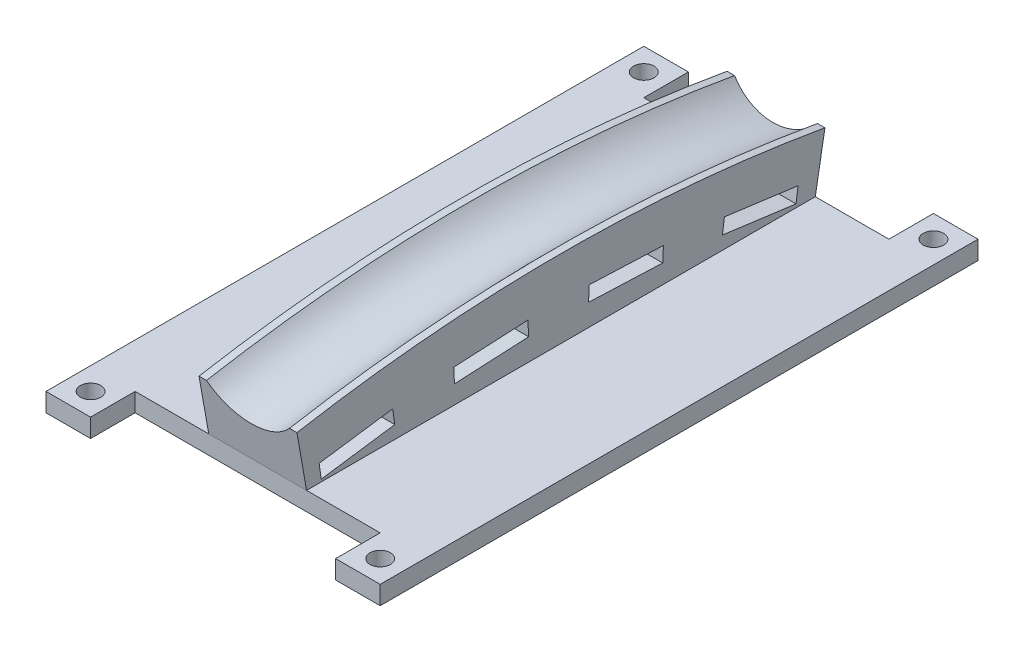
ISO-10303-21;
HEADER;
FILE_DESCRIPTION(('STEP AP214'),'2;1');
FILE_NAME('part.step','',(''),(''),'','','');
FILE_SCHEMA(('AUTOMOTIVE_DESIGN { 1 0 10303 214 1 1 1 1 }'));
ENDSEC;
DATA;
#1=APPLICATION_CONTEXT('core data for automotive mechanical design processes');
#2=APPLICATION_PROTOCOL_DEFINITION('international standard','automotive_design',2000,#1);
#3=PRODUCT_CONTEXT('',#1,'mechanical');
#4=PRODUCT('Part','Part','',(#3));
#5=PRODUCT_RELATED_PRODUCT_CATEGORY('part','',(#4));
#6=PRODUCT_DEFINITION_FORMATION('','',#4);
#7=PRODUCT_DEFINITION_CONTEXT('part definition',#1,'design');
#8=PRODUCT_DEFINITION('design','',#6,#7);
#9=PRODUCT_DEFINITION_SHAPE('','',#8);
#10=(LENGTH_UNIT() NAMED_UNIT(*) SI_UNIT(.MILLI.,.METRE.));
#11=(NAMED_UNIT(*) PLANE_ANGLE_UNIT() SI_UNIT($,.RADIAN.));
#12=(NAMED_UNIT(*) SI_UNIT($,.STERADIAN.) SOLID_ANGLE_UNIT());
#13=UNCERTAINTY_MEASURE_WITH_UNIT(LENGTH_MEASURE(1.E-05),#10,'distance_accuracy_value','');
#14=(GEOMETRIC_REPRESENTATION_CONTEXT(3) GLOBAL_UNCERTAINTY_ASSIGNED_CONTEXT((#13)) GLOBAL_UNIT_ASSIGNED_CONTEXT((#10,
#11,#12)) REPRESENTATION_CONTEXT('',''));
#15=CARTESIAN_POINT('',(0.,0.,0.));
#16=DIRECTION('',(0.,0.,1.));
#17=DIRECTION('',(1.,0.,0.));
#18=AXIS2_PLACEMENT_3D('',#15,#16,#17);
#19=CARTESIAN_POINT('',(0.,5.,0.));
#20=DIRECTION('',(0.,1.,0.));
#21=DIRECTION('',(0.,0.,1.));
#22=AXIS2_PLACEMENT_3D('',#19,#20,#21);
#23=PLANE('',#22);
#24=CARTESIAN_POINT('',(6.00000000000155,5.,-6.00000000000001));
#25=DIRECTION('',(0.,1.,0.));
#26=DIRECTION('',(0.,0.,1.));
#27=AXIS2_PLACEMENT_3D('',#24,#25,#26);
#28=CIRCLE('',#27,2.75);
#29=CARTESIAN_POINT('',(6.00000000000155,5.,-3.25));
#30=VERTEX_POINT('',#29);
#31=EDGE_CURVE('E469',#30,#30,#28,.T.);
#32=ORIENTED_EDGE('',*,*,#31,.F.);
#33=EDGE_LOOP('',(#32));
#34=FACE_BOUND('',#33,.T.);
#35=CARTESIAN_POINT('',(6.,5.,-155.));
#36=DIRECTION('',(0.,1.,0.));
#37=DIRECTION('',(0.,0.,1.));
#38=AXIS2_PLACEMENT_3D('',#35,#36,#37);
#39=CIRCLE('',#38,2.75);
#40=CARTESIAN_POINT('',(6.,5.,-152.25));
#41=VERTEX_POINT('',#40);
#42=EDGE_CURVE('E487',#41,#41,#39,.T.);
#43=ORIENTED_EDGE('',*,*,#42,.F.);
#44=EDGE_LOOP('',(#43));
#45=FACE_BOUND('',#44,.T.);
#46=DIRECTION('',(1.,0.,0.));
#47=VECTOR('',#46,1.);
#48=CARTESIAN_POINT('',(12.,5.,-12.));
#49=LINE('',#48,#47);
#50=CARTESIAN_POINT('',(12.,5.,-12.));
#51=VERTEX_POINT('',#50);
#52=CARTESIAN_POINT('',(31.8196601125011,5.,-12.));
#53=VERTEX_POINT('',#52);
#54=EDGE_CURVE('E502',#51,#53,#49,.T.);
#55=ORIENTED_EDGE('',*,*,#54,.T.);
#56=DIRECTION('',(0.,0.,-1.));
#57=VECTOR('',#56,1.);
#58=CARTESIAN_POINT('',(31.8196601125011,5.,-12.));
#59=LINE('',#58,#57);
#60=CARTESIAN_POINT('',(31.8196601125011,5.,-149.));
#61=VERTEX_POINT('',#60);
#62=EDGE_CURVE('E460',#53,#61,#59,.T.);
#63=ORIENTED_EDGE('',*,*,#62,.T.);
#64=DIRECTION('',(-1.,0.,0.));
#65=VECTOR('',#64,1.);
#66=CARTESIAN_POINT('',(78.,5.,-149.));
#67=LINE('',#66,#65);
#68=CARTESIAN_POINT('',(12.,5.,-149.));
#69=VERTEX_POINT('',#68);
#70=EDGE_CURVE('E515',#61,#69,#67,.T.);
#71=ORIENTED_EDGE('',*,*,#70,.T.);
#72=DIRECTION('',(0.,0.,-1.));
#73=VECTOR('',#72,1.);
#74=CARTESIAN_POINT('',(12.,5.,-149.));
#75=LINE('',#74,#73);
#76=CARTESIAN_POINT('',(12.,5.,-161.));
#77=VERTEX_POINT('',#76);
#78=EDGE_CURVE('E518',#69,#77,#75,.T.);
#79=ORIENTED_EDGE('',*,*,#78,.T.);
#80=DIRECTION('',(-1.,0.,0.));
#81=VECTOR('',#80,1.);
#82=CARTESIAN_POINT('',(12.,5.,-161.));
#83=LINE('',#82,#81);
#84=CARTESIAN_POINT('',(0.,5.,-161.));
#85=VERTEX_POINT('',#84);
#86=EDGE_CURVE('E520',#77,#85,#83,.T.);
#87=ORIENTED_EDGE('',*,*,#86,.T.);
#88=DIRECTION('',(0.,0.,1.));
#89=VECTOR('',#88,1.);
#90=CARTESIAN_POINT('',(0.,5.,-161.));
#91=LINE('',#90,#89);
#92=CARTESIAN_POINT('',(0.,5.,0.));
#93=VERTEX_POINT('',#92);
#94=EDGE_CURVE('E493',#85,#93,#91,.T.);
#95=ORIENTED_EDGE('',*,*,#94,.T.);
#96=DIRECTION('',(1.,0.,0.));
#97=VECTOR('',#96,1.);
#98=CARTESIAN_POINT('',(0.,5.,0.));
#99=LINE('',#98,#97);
#100=CARTESIAN_POINT('',(12.,5.,0.));
#101=VERTEX_POINT('',#100);
#102=EDGE_CURVE('E496',#93,#101,#99,.T.);
#103=ORIENTED_EDGE('',*,*,#102,.T.);
#104=DIRECTION('',(0.,0.,-1.));
#105=VECTOR('',#104,1.);
#106=CARTESIAN_POINT('',(12.,5.,0.));
#107=LINE('',#106,#105);
#108=EDGE_CURVE('E499',#101,#51,#107,.T.);
#109=ORIENTED_EDGE('',*,*,#108,.T.);
#110=EDGE_LOOP('',(#55,#63,#71,#79,#87,#95,#103,#109));
#111=FACE_BOUND('',#110,.T.);
#112=ADVANCED_FACE('F44',(#34,#45,#111),#23,.T.);
#113=DIRECTION('',(0.,0.,-1.));
#114=VECTOR('',#113,1.);
#115=CARTESIAN_POINT('',(58.1803398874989,5.,-12.));
#116=LINE('',#115,#114);
#117=CARTESIAN_POINT('',(58.1803398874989,5.,-12.));
#118=VERTEX_POINT('',#117);
#119=CARTESIAN_POINT('',(58.1803398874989,5.,-149.));
#120=VERTEX_POINT('',#119);
#121=EDGE_CURVE('E452',#118,#120,#116,.T.);
#122=ORIENTED_EDGE('',*,*,#121,.F.);
#123=CARTESIAN_POINT('',(78.,5.,-12.));
#124=VERTEX_POINT('',#123);
#125=EDGE_CURVE('E501',#118,#124,#49,.T.);
#126=ORIENTED_EDGE('',*,*,#125,.T.);
#127=DIRECTION('',(0.,0.,1.));
#128=VECTOR('',#127,1.);
#129=CARTESIAN_POINT('',(78.,5.,-12.));
#130=LINE('',#129,#128);
#131=CARTESIAN_POINT('',(78.,5.,0.));
#132=VERTEX_POINT('',#131);
#133=EDGE_CURVE('E505',#124,#132,#130,.T.);
#134=ORIENTED_EDGE('',*,*,#133,.T.);
#135=DIRECTION('',(1.,0.,0.));
#136=VECTOR('',#135,1.);
#137=CARTESIAN_POINT('',(78.,5.,0.));
#138=LINE('',#137,#136);
#139=CARTESIAN_POINT('',(90.,5.,0.));
#140=VERTEX_POINT('',#139);
#141=EDGE_CURVE('E507',#132,#140,#138,.T.);
#142=ORIENTED_EDGE('',*,*,#141,.T.);
#143=DIRECTION('',(0.,0.,-1.));
#144=VECTOR('',#143,1.);
#145=CARTESIAN_POINT('',(90.,5.,0.));
#146=LINE('',#145,#144);
#147=CARTESIAN_POINT('',(90.,5.,-161.));
#148=VERTEX_POINT('',#147);
#149=EDGE_CURVE('E509',#140,#148,#146,.T.);
#150=ORIENTED_EDGE('',*,*,#149,.T.);
#151=DIRECTION('',(-1.,0.,0.));
#152=VECTOR('',#151,1.);
#153=CARTESIAN_POINT('',(90.,5.,-161.));
#154=LINE('',#153,#152);
#155=CARTESIAN_POINT('',(78.,5.,-161.));
#156=VERTEX_POINT('',#155);
#157=EDGE_CURVE('E511',#148,#156,#154,.T.);
#158=ORIENTED_EDGE('',*,*,#157,.T.);
#159=DIRECTION('',(0.,0.,1.));
#160=VECTOR('',#159,1.);
#161=CARTESIAN_POINT('',(78.,5.,-161.));
#162=LINE('',#161,#160);
#163=CARTESIAN_POINT('',(78.,5.,-149.));
#164=VERTEX_POINT('',#163);
#165=EDGE_CURVE('E513',#156,#164,#162,.T.);
#166=ORIENTED_EDGE('',*,*,#165,.T.);
#167=EDGE_CURVE('E516',#164,#120,#67,.T.);
#168=ORIENTED_EDGE('',*,*,#167,.T.);
#169=EDGE_LOOP('',(#122,#126,#134,#142,#150,#158,#166,#168));
#170=FACE_BOUND('',#169,.T.);
#171=CARTESIAN_POINT('',(84.0000000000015,5.,-6.00000000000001));
#172=DIRECTION('',(0.,1.,0.));
#173=DIRECTION('',(0.,0.,1.));
#174=AXIS2_PLACEMENT_3D('',#171,#172,#173);
#175=CIRCLE('',#174,2.75000000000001);
#176=CARTESIAN_POINT('',(84.0000000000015,5.,-3.25));
#177=VERTEX_POINT('',#176);
#178=EDGE_CURVE('E475',#177,#177,#175,.T.);
#179=ORIENTED_EDGE('',*,*,#178,.F.);
#180=EDGE_LOOP('',(#179));
#181=FACE_BOUND('',#180,.T.);
#182=CARTESIAN_POINT('',(84.,5.,-155.));
#183=DIRECTION('',(0.,1.,0.));
#184=DIRECTION('',(0.,0.,1.));
#185=AXIS2_PLACEMENT_3D('',#182,#183,#184);
#186=CIRCLE('',#185,2.75000000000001);
#187=CARTESIAN_POINT('',(84.,5.,-152.25));
#188=VERTEX_POINT('',#187);
#189=EDGE_CURVE('E481',#188,#188,#186,.T.);
#190=ORIENTED_EDGE('',*,*,#189,.F.);
#191=EDGE_LOOP('',(#190));
#192=FACE_BOUND('',#191,.T.);
#193=ADVANCED_FACE('F600',(#170,#181,#192),#23,.T.);
#194=CARTESIAN_POINT('',(0.,0.,0.));
#195=DIRECTION('',(0.,1.,0.));
#196=DIRECTION('',(0.,0.,1.));
#197=AXIS2_PLACEMENT_3D('',#194,#195,#196);
#198=PLANE('',#197);
#199=DIRECTION('',(0.,0.,1.));
#200=VECTOR('',#199,1.);
#201=CARTESIAN_POINT('',(0.,0.,-161.));
#202=LINE('',#201,#200);
#203=CARTESIAN_POINT('',(0.,0.,-161.));
#204=VERTEX_POINT('',#203);
#205=CARTESIAN_POINT('',(0.,0.,0.));
#206=VERTEX_POINT('',#205);
#207=EDGE_CURVE('E490',#204,#206,#202,.T.);
#208=ORIENTED_EDGE('',*,*,#207,.F.);
#209=DIRECTION('',(-1.,0.,0.));
#210=VECTOR('',#209,1.);
#211=CARTESIAN_POINT('',(12.,0.,-161.));
#212=LINE('',#211,#210);
#213=CARTESIAN_POINT('',(12.,0.,-161.));
#214=VERTEX_POINT('',#213);
#215=EDGE_CURVE('E497',#214,#204,#212,.T.);
#216=ORIENTED_EDGE('',*,*,#215,.F.);
#217=DIRECTION('',(0.,0.,-1.));
#218=VECTOR('',#217,1.);
#219=CARTESIAN_POINT('',(12.,0.,-149.));
#220=LINE('',#219,#218);
#221=CARTESIAN_POINT('',(12.,0.,-149.));
#222=VERTEX_POINT('',#221);
#223=EDGE_CURVE('E543',#222,#214,#220,.T.);
#224=ORIENTED_EDGE('',*,*,#223,.F.);
#225=DIRECTION('',(-1.,0.,0.));
#226=VECTOR('',#225,1.);
#227=CARTESIAN_POINT('',(78.,0.,-149.));
#228=LINE('',#227,#226);
#229=CARTESIAN_POINT('',(78.,0.,-149.));
#230=VERTEX_POINT('',#229);
#231=EDGE_CURVE('E541',#230,#222,#228,.T.);
#232=ORIENTED_EDGE('',*,*,#231,.F.);
#233=DIRECTION('',(0.,0.,1.));
#234=VECTOR('',#233,1.);
#235=CARTESIAN_POINT('',(78.,0.,-161.));
#236=LINE('',#235,#234);
#237=CARTESIAN_POINT('',(78.,0.,-161.));
#238=VERTEX_POINT('',#237);
#239=EDGE_CURVE('E539',#238,#230,#236,.T.);
#240=ORIENTED_EDGE('',*,*,#239,.F.);
#241=DIRECTION('',(-1.,0.,0.));
#242=VECTOR('',#241,1.);
#243=CARTESIAN_POINT('',(90.,0.,-161.));
#244=LINE('',#243,#242);
#245=CARTESIAN_POINT('',(90.,0.,-161.));
#246=VERTEX_POINT('',#245);
#247=EDGE_CURVE('E537',#246,#238,#244,.T.);
#248=ORIENTED_EDGE('',*,*,#247,.F.);
#249=DIRECTION('',(0.,0.,-1.));
#250=VECTOR('',#249,1.);
#251=CARTESIAN_POINT('',(90.,0.,0.));
#252=LINE('',#251,#250);
#253=CARTESIAN_POINT('',(90.,0.,0.));
#254=VERTEX_POINT('',#253);
#255=EDGE_CURVE('E535',#254,#246,#252,.T.);
#256=ORIENTED_EDGE('',*,*,#255,.F.);
#257=DIRECTION('',(1.,0.,0.));
#258=VECTOR('',#257,1.);
#259=CARTESIAN_POINT('',(78.,0.,0.));
#260=LINE('',#259,#258);
#261=CARTESIAN_POINT('',(78.,0.,0.));
#262=VERTEX_POINT('',#261);
#263=EDGE_CURVE('E533',#262,#254,#260,.T.);
#264=ORIENTED_EDGE('',*,*,#263,.F.);
#265=DIRECTION('',(0.,0.,1.));
#266=VECTOR('',#265,1.);
#267=CARTESIAN_POINT('',(78.,0.,-12.));
#268=LINE('',#267,#266);
#269=CARTESIAN_POINT('',(78.,0.,-12.));
#270=VERTEX_POINT('',#269);
#271=EDGE_CURVE('E531',#270,#262,#268,.T.);
#272=ORIENTED_EDGE('',*,*,#271,.F.);
#273=DIRECTION('',(1.,0.,0.));
#274=VECTOR('',#273,1.);
#275=CARTESIAN_POINT('',(12.,0.,-12.));
#276=LINE('',#275,#274);
#277=CARTESIAN_POINT('',(12.,0.,-12.));
#278=VERTEX_POINT('',#277);
#279=EDGE_CURVE('E529',#278,#270,#276,.T.);
#280=ORIENTED_EDGE('',*,*,#279,.F.);
#281=DIRECTION('',(0.,0.,-1.));
#282=VECTOR('',#281,1.);
#283=CARTESIAN_POINT('',(12.,0.,0.));
#284=LINE('',#283,#282);
#285=CARTESIAN_POINT('',(12.,0.,0.));
#286=VERTEX_POINT('',#285);
#287=EDGE_CURVE('E527',#286,#278,#284,.T.);
#288=ORIENTED_EDGE('',*,*,#287,.F.);
#289=DIRECTION('',(1.,0.,0.));
#290=VECTOR('',#289,1.);
#291=CARTESIAN_POINT('',(0.,0.,0.));
#292=LINE('',#291,#290);
#293=EDGE_CURVE('E525',#206,#286,#292,.T.);
#294=ORIENTED_EDGE('',*,*,#293,.F.);
#295=EDGE_LOOP('',(#208,#216,#224,#232,#240,#248,#256,#264,#272,#280,#288,#294));
#296=FACE_BOUND('',#295,.T.);
#297=CARTESIAN_POINT('',(6.,0.,-155.));
#298=DIRECTION('',(0.,1.,0.));
#299=DIRECTION('',(0.,0.,1.));
#300=AXIS2_PLACEMENT_3D('',#297,#298,#299);
#301=CIRCLE('',#300,2.75);
#302=CARTESIAN_POINT('',(6.,0.,-152.25));
#303=VERTEX_POINT('',#302);
#304=EDGE_CURVE('E484',#303,#303,#301,.T.);
#305=ORIENTED_EDGE('',*,*,#304,.T.);
#306=EDGE_LOOP('',(#305));
#307=FACE_BOUND('',#306,.T.);
#308=CARTESIAN_POINT('',(84.,0.,-155.));
#309=DIRECTION('',(0.,1.,0.));
#310=DIRECTION('',(0.,0.,1.));
#311=AXIS2_PLACEMENT_3D('',#308,#309,#310);
#312=CIRCLE('',#311,2.75000000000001);
#313=CARTESIAN_POINT('',(84.,0.,-152.25));
#314=VERTEX_POINT('',#313);
#315=EDGE_CURVE('E478',#314,#314,#312,.T.);
#316=ORIENTED_EDGE('',*,*,#315,.T.);
#317=EDGE_LOOP('',(#316));
#318=FACE_BOUND('',#317,.T.);
#319=CARTESIAN_POINT('',(84.0000000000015,0.,-6.00000000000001));
#320=DIRECTION('',(0.,1.,0.));
#321=DIRECTION('',(0.,0.,1.));
#322=AXIS2_PLACEMENT_3D('',#319,#320,#321);
#323=CIRCLE('',#322,2.75000000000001);
#324=CARTESIAN_POINT('',(84.0000000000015,0.,-3.25));
#325=VERTEX_POINT('',#324);
#326=EDGE_CURVE('E472',#325,#325,#323,.T.);
#327=ORIENTED_EDGE('',*,*,#326,.T.);
#328=EDGE_LOOP('',(#327));
#329=FACE_BOUND('',#328,.T.);
#330=CARTESIAN_POINT('',(6.00000000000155,0.,-6.00000000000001));
#331=DIRECTION('',(0.,1.,0.));
#332=DIRECTION('',(0.,0.,1.));
#333=AXIS2_PLACEMENT_3D('',#330,#331,#332);
#334=CIRCLE('',#333,2.75);
#335=CARTESIAN_POINT('',(6.00000000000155,0.,-3.25));
#336=VERTEX_POINT('',#335);
#337=EDGE_CURVE('E468',#336,#336,#334,.T.);
#338=ORIENTED_EDGE('',*,*,#337,.T.);
#339=EDGE_LOOP('',(#338));
#340=FACE_BOUND('',#339,.T.);
#341=ADVANCED_FACE('F585',(#296,#307,#318,#329,#340),#198,.F.);
#342=CARTESIAN_POINT('',(0.,5.,-161.));
#343=DIRECTION('',(1.,0.,0.));
#344=DIRECTION('',(0.,0.,-1.));
#345=AXIS2_PLACEMENT_3D('',#342,#343,#344);
#346=PLANE('',#345);
#347=ORIENTED_EDGE('',*,*,#207,.T.);
#348=DIRECTION('',(0.,-1.,0.));
#349=VECTOR('',#348,1.);
#350=CARTESIAN_POINT('',(0.,5.,0.));
#351=LINE('',#350,#349);
#352=EDGE_CURVE('E11',#93,#206,#351,.T.);
#353=ORIENTED_EDGE('',*,*,#352,.F.);
#354=ORIENTED_EDGE('',*,*,#94,.F.);
#355=DIRECTION('',(0.,-1.,0.));
#356=VECTOR('',#355,1.);
#357=CARTESIAN_POINT('',(0.,5.,-161.));
#358=LINE('',#357,#356);
#359=EDGE_CURVE('E522',#85,#204,#358,.T.);
#360=ORIENTED_EDGE('',*,*,#359,.T.);
#361=EDGE_LOOP('',(#347,#353,#354,#360));
#362=FACE_BOUND('',#361,.T.);
#363=ADVANCED_FACE('F46',(#362),#346,.F.);
#364=CARTESIAN_POINT('',(0.,5.,0.));
#365=DIRECTION('',(0.,0.,-1.));
#366=DIRECTION('',(-1.,0.,0.));
#367=AXIS2_PLACEMENT_3D('',#364,#365,#366);
#368=PLANE('',#367);
#369=ORIENTED_EDGE('',*,*,#293,.T.);
#370=DIRECTION('',(0.,-1.,0.));
#371=VECTOR('',#370,1.);
#372=CARTESIAN_POINT('',(12.,5.,0.));
#373=LINE('',#372,#371);
#374=EDGE_CURVE('E52',#101,#286,#373,.T.);
#375=ORIENTED_EDGE('',*,*,#374,.F.);
#376=ORIENTED_EDGE('',*,*,#102,.F.);
#377=ORIENTED_EDGE('',*,*,#352,.T.);
#378=EDGE_LOOP('',(#369,#375,#376,#377));
#379=FACE_BOUND('',#378,.T.);
#380=ADVANCED_FACE('F698',(#379),#368,.F.);
#381=CARTESIAN_POINT('',(12.,5.,0.));
#382=DIRECTION('',(-1.,0.,0.));
#383=DIRECTION('',(0.,0.,1.));
#384=AXIS2_PLACEMENT_3D('',#381,#382,#383);
#385=PLANE('',#384);
#386=ORIENTED_EDGE('',*,*,#287,.T.);
#387=DIRECTION('',(0.,-1.,0.));
#388=VECTOR('',#387,1.);
#389=CARTESIAN_POINT('',(12.,5.,-12.));
#390=LINE('',#389,#388);
#391=EDGE_CURVE('E572',#51,#278,#390,.T.);
#392=ORIENTED_EDGE('',*,*,#391,.F.);
#393=ORIENTED_EDGE('',*,*,#108,.F.);
#394=ORIENTED_EDGE('',*,*,#374,.T.);
#395=EDGE_LOOP('',(#386,#392,#393,#394));
#396=FACE_BOUND('',#395,.T.);
#397=ADVANCED_FACE('F579',(#396),#385,.F.);
#398=CARTESIAN_POINT('',(12.,5.,-12.));
#399=DIRECTION('',(0.,0.,-1.));
#400=DIRECTION('',(-1.,0.,0.));
#401=AXIS2_PLACEMENT_3D('',#398,#399,#400);
#402=PLANE('',#401);
#403=ORIENTED_EDGE('',*,*,#279,.T.);
#404=DIRECTION('',(0.,-1.,0.));
#405=VECTOR('',#404,1.);
#406=CARTESIAN_POINT('',(78.,5.,-12.));
#407=LINE('',#406,#405);
#408=EDGE_CURVE('E569',#124,#270,#407,.T.);
#409=ORIENTED_EDGE('',*,*,#408,.F.);
#410=ORIENTED_EDGE('',*,*,#125,.F.);
#411=DIRECTION('',(1.,0.,0.));
#412=VECTOR('',#411,1.);
#413=CARTESIAN_POINT('',(-105.953928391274,5.,-12.));
#414=LINE('',#413,#412);
#415=EDGE_CURVE('E465',#53,#118,#414,.T.);
#416=ORIENTED_EDGE('',*,*,#415,.F.);
#417=ORIENTED_EDGE('',*,*,#54,.F.);
#418=ORIENTED_EDGE('',*,*,#391,.T.);
#419=EDGE_LOOP('',(#403,#409,#410,#416,#417,#418));
#420=FACE_BOUND('',#419,.T.);
#421=ADVANCED_FACE('F591',(#420),#402,.F.);
#422=CARTESIAN_POINT('',(78.,5.,-12.));
#423=DIRECTION('',(1.,0.,0.));
#424=DIRECTION('',(0.,0.,-1.));
#425=AXIS2_PLACEMENT_3D('',#422,#423,#424);
#426=PLANE('',#425);
#427=ORIENTED_EDGE('',*,*,#271,.T.);
#428=DIRECTION('',(0.,-1.,0.));
#429=VECTOR('',#428,1.);
#430=CARTESIAN_POINT('',(78.,5.,0.));
#431=LINE('',#430,#429);
#432=EDGE_CURVE('E566',#132,#262,#431,.T.);
#433=ORIENTED_EDGE('',*,*,#432,.F.);
#434=ORIENTED_EDGE('',*,*,#133,.F.);
#435=ORIENTED_EDGE('',*,*,#408,.T.);
#436=EDGE_LOOP('',(#427,#433,#434,#435));
#437=FACE_BOUND('',#436,.T.);
#438=ADVANCED_FACE('F595',(#437),#426,.F.);
#439=CARTESIAN_POINT('',(78.,5.,0.));
#440=DIRECTION('',(0.,0.,-1.));
#441=DIRECTION('',(-1.,0.,0.));
#442=AXIS2_PLACEMENT_3D('',#439,#440,#441);
#443=PLANE('',#442);
#444=ORIENTED_EDGE('',*,*,#263,.T.);
#445=DIRECTION('',(0.,-1.,0.));
#446=VECTOR('',#445,1.);
#447=CARTESIAN_POINT('',(90.,5.,0.));
#448=LINE('',#447,#446);
#449=EDGE_CURVE('E563',#140,#254,#448,.T.);
#450=ORIENTED_EDGE('',*,*,#449,.F.);
#451=ORIENTED_EDGE('',*,*,#141,.F.);
#452=ORIENTED_EDGE('',*,*,#432,.T.);
#453=EDGE_LOOP('',(#444,#450,#451,#452));
#454=FACE_BOUND('',#453,.T.);
#455=ADVANCED_FACE('F688',(#454),#443,.F.);
#456=CARTESIAN_POINT('',(90.,5.,0.));
#457=DIRECTION('',(-1.,0.,0.));
#458=DIRECTION('',(0.,0.,1.));
#459=AXIS2_PLACEMENT_3D('',#456,#457,#458);
#460=PLANE('',#459);
#461=ORIENTED_EDGE('',*,*,#255,.T.);
#462=DIRECTION('',(0.,-1.,0.));
#463=VECTOR('',#462,1.);
#464=CARTESIAN_POINT('',(90.,5.,-161.));
#465=LINE('',#464,#463);
#466=EDGE_CURVE('E560',#148,#246,#465,.T.);
#467=ORIENTED_EDGE('',*,*,#466,.F.);
#468=ORIENTED_EDGE('',*,*,#149,.F.);
#469=ORIENTED_EDGE('',*,*,#449,.T.);
#470=EDGE_LOOP('',(#461,#467,#468,#469));
#471=FACE_BOUND('',#470,.T.);
#472=ADVANCED_FACE('F684',(#471),#460,.F.);
#473=CARTESIAN_POINT('',(90.,5.,-161.));
#474=DIRECTION('',(0.,0.,1.));
#475=DIRECTION('',(1.,0.,0.));
#476=AXIS2_PLACEMENT_3D('',#473,#474,#475);
#477=PLANE('',#476);
#478=ORIENTED_EDGE('',*,*,#247,.T.);
#479=DIRECTION('',(0.,-1.,0.));
#480=VECTOR('',#479,1.);
#481=CARTESIAN_POINT('',(78.,5.,-161.));
#482=LINE('',#481,#480);
#483=EDGE_CURVE('E557',#156,#238,#482,.T.);
#484=ORIENTED_EDGE('',*,*,#483,.F.);
#485=ORIENTED_EDGE('',*,*,#157,.F.);
#486=ORIENTED_EDGE('',*,*,#466,.T.);
#487=EDGE_LOOP('',(#478,#484,#485,#486));
#488=FACE_BOUND('',#487,.T.);
#489=ADVANCED_FACE('F680',(#488),#477,.F.);
#490=CARTESIAN_POINT('',(78.,5.,-161.));
#491=DIRECTION('',(1.,0.,0.));
#492=DIRECTION('',(0.,0.,-1.));
#493=AXIS2_PLACEMENT_3D('',#490,#491,#492);
#494=PLANE('',#493);
#495=ORIENTED_EDGE('',*,*,#239,.T.);
#496=DIRECTION('',(0.,-1.,0.));
#497=VECTOR('',#496,1.);
#498=CARTESIAN_POINT('',(78.,5.,-149.));
#499=LINE('',#498,#497);
#500=EDGE_CURVE('E554',#164,#230,#499,.T.);
#501=ORIENTED_EDGE('',*,*,#500,.F.);
#502=ORIENTED_EDGE('',*,*,#165,.F.);
#503=ORIENTED_EDGE('',*,*,#483,.T.);
#504=EDGE_LOOP('',(#495,#501,#502,#503));
#505=FACE_BOUND('',#504,.T.);
#506=ADVANCED_FACE('F677',(#505),#494,.F.);
#507=CARTESIAN_POINT('',(78.,5.,-149.));
#508=DIRECTION('',(0.,0.,1.));
#509=DIRECTION('',(1.,0.,0.));
#510=AXIS2_PLACEMENT_3D('',#507,#508,#509);
#511=PLANE('',#510);
#512=ORIENTED_EDGE('',*,*,#231,.T.);
#513=DIRECTION('',(0.,-1.,0.));
#514=VECTOR('',#513,1.);
#515=CARTESIAN_POINT('',(12.,5.,-149.));
#516=LINE('',#515,#514);
#517=EDGE_CURVE('E551',#69,#222,#516,.T.);
#518=ORIENTED_EDGE('',*,*,#517,.F.);
#519=ORIENTED_EDGE('',*,*,#70,.F.);
#520=DIRECTION('',(1.,0.,0.));
#521=VECTOR('',#520,1.);
#522=CARTESIAN_POINT('',(-105.953928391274,5.,-149.));
#523=LINE('',#522,#521);
#524=EDGE_CURVE('E462',#61,#120,#523,.T.);
#525=ORIENTED_EDGE('',*,*,#524,.T.);
#526=ORIENTED_EDGE('',*,*,#167,.F.);
#527=ORIENTED_EDGE('',*,*,#500,.T.);
#528=EDGE_LOOP('',(#512,#518,#519,#525,#526,#527));
#529=FACE_BOUND('',#528,.T.);
#530=ADVANCED_FACE('F630',(#529),#511,.F.);
#531=CARTESIAN_POINT('',(12.,5.,-149.));
#532=DIRECTION('',(-1.,0.,0.));
#533=DIRECTION('',(0.,0.,1.));
#534=AXIS2_PLACEMENT_3D('',#531,#532,#533);
#535=PLANE('',#534);
#536=ORIENTED_EDGE('',*,*,#223,.T.);
#537=DIRECTION('',(0.,-1.,0.));
#538=VECTOR('',#537,1.);
#539=CARTESIAN_POINT('',(12.,5.,-161.));
#540=LINE('',#539,#538);
#541=EDGE_CURVE('E548',#77,#214,#540,.T.);
#542=ORIENTED_EDGE('',*,*,#541,.F.);
#543=ORIENTED_EDGE('',*,*,#78,.F.);
#544=ORIENTED_EDGE('',*,*,#517,.T.);
#545=EDGE_LOOP('',(#536,#542,#543,#544));
#546=FACE_BOUND('',#545,.T.);
#547=ADVANCED_FACE('F670',(#546),#535,.F.);
#548=CARTESIAN_POINT('',(12.,5.,-161.));
#549=DIRECTION('',(0.,0.,1.));
#550=DIRECTION('',(1.,0.,0.));
#551=AXIS2_PLACEMENT_3D('',#548,#549,#550);
#552=PLANE('',#551);
#553=ORIENTED_EDGE('',*,*,#215,.T.);
#554=ORIENTED_EDGE('',*,*,#359,.F.);
#555=ORIENTED_EDGE('',*,*,#86,.F.);
#556=ORIENTED_EDGE('',*,*,#541,.T.);
#557=EDGE_LOOP('',(#553,#554,#555,#556));
#558=FACE_BOUND('',#557,.T.);
#559=ADVANCED_FACE('F667',(#558),#552,.F.);
#560=CARTESIAN_POINT('',(6.,5.,-155.));
#561=DIRECTION('',(0.,-1.,0.));
#562=DIRECTION('',(0.,0.,-1.));
#563=AXIS2_PLACEMENT_3D('',#560,#561,#562);
#564=CYLINDRICAL_SURFACE('',#563,2.75);
#565=ORIENTED_EDGE('',*,*,#42,.T.);
#566=EDGE_LOOP('',(#565));
#567=FACE_BOUND('',#566,.T.);
#568=ORIENTED_EDGE('',*,*,#304,.F.);
#569=EDGE_LOOP('',(#568));
#570=FACE_BOUND('',#569,.T.);
#571=ADVANCED_FACE('F663',(#567,#570),#564,.F.);
#572=CARTESIAN_POINT('',(84.,5.,-155.));
#573=DIRECTION('',(0.,-1.,0.));
#574=DIRECTION('',(0.,0.,-1.));
#575=AXIS2_PLACEMENT_3D('',#572,#573,#574);
#576=CYLINDRICAL_SURFACE('',#575,2.75000000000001);
#577=ORIENTED_EDGE('',*,*,#189,.T.);
#578=EDGE_LOOP('',(#577));
#579=FACE_BOUND('',#578,.T.);
#580=ORIENTED_EDGE('',*,*,#315,.F.);
#581=EDGE_LOOP('',(#580));
#582=FACE_BOUND('',#581,.T.);
#583=ADVANCED_FACE('F1035',(#579,#582),#576,.F.);
#584=CARTESIAN_POINT('',(84.0000000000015,5.,-6.00000000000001));
#585=DIRECTION('',(0.,-1.,0.));
#586=DIRECTION('',(0.,0.,-1.));
#587=AXIS2_PLACEMENT_3D('',#584,#585,#586);
#588=CYLINDRICAL_SURFACE('',#587,2.75000000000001);
#589=ORIENTED_EDGE('',*,*,#178,.T.);
#590=EDGE_LOOP('',(#589));
#591=FACE_BOUND('',#590,.T.);
#592=ORIENTED_EDGE('',*,*,#326,.F.);
#593=EDGE_LOOP('',(#592));
#594=FACE_BOUND('',#593,.T.);
#595=ADVANCED_FACE('F1032',(#591,#594),#588,.F.);
#596=CARTESIAN_POINT('',(6.00000000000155,5.,-6.00000000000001));
#597=DIRECTION('',(0.,-1.,0.));
#598=DIRECTION('',(0.,0.,-1.));
#599=AXIS2_PLACEMENT_3D('',#596,#597,#598);
#600=CYLINDRICAL_SURFACE('',#599,2.75);
#601=ORIENTED_EDGE('',*,*,#31,.T.);
#602=EDGE_LOOP('',(#601));
#603=FACE_BOUND('',#602,.T.);
#604=ORIENTED_EDGE('',*,*,#337,.F.);
#605=EDGE_LOOP('',(#604));
#606=FACE_BOUND('',#605,.T.);
#607=ADVANCED_FACE('F811',(#603,#606),#600,.F.);
#608=CARTESIAN_POINT('',(31.8196601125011,19.7722899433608,-9.396262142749));
#609=DIRECTION('',(-1.,0.,0.));
#610=DIRECTION('',(0.,0.,1.));
#611=AXIS2_PLACEMENT_3D('',#608,#609,#610);
#612=PLANE('',#611);
#613=DIRECTION('',(0.,-0.050246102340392,0.998736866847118));
#614=VECTOR('',#613,1.);
#615=CARTESIAN_POINT('',(31.8196601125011,7.8214994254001,-9.99750223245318));
#616=LINE('',#615,#614);
#617=CARTESIAN_POINT('',(31.8196601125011,10.9307006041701,-71.7987902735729));
#618=VERTEX_POINT('',#617);
#619=CARTESIAN_POINT('',(31.8196601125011,9.92577855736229,-51.8240529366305));
#620=VERTEX_POINT('',#619);
#621=EDGE_CURVE('E368',#618,#620,#616,.T.);
#622=ORIENTED_EDGE('',*,*,#621,.F.);
#623=DIRECTION('',(0.,-0.998736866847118,-0.0502461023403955));
#624=VECTOR('',#623,1.);
#625=CARTESIAN_POINT('',(31.8196601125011,22.881491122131,-71.1975501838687));
#626=LINE('',#625,#624);
#627=CARTESIAN_POINT('',(31.8196601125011,14.9256480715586,-71.5978058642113));
#628=VERTEX_POINT('',#627);
#629=EDGE_CURVE('E363',#628,#618,#626,.T.);
#630=ORIENTED_EDGE('',*,*,#629,.F.);
#631=DIRECTION('',(0.,0.050246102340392,-0.998736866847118));
#632=VECTOR('',#631,1.);
#633=CARTESIAN_POINT('',(31.8196601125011,11.8164468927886,-9.79651782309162));
#634=LINE('',#633,#632);
#635=CARTESIAN_POINT('',(31.8196601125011,13.9207260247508,-51.623068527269));
#636=VERTEX_POINT('',#635);
#637=EDGE_CURVE('E282',#636,#628,#634,.T.);
#638=ORIENTED_EDGE('',*,*,#637,.F.);
#639=DIRECTION('',(0.,0.998736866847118,0.0502461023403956));
#640=VECTOR('',#639,1.);
#641=CARTESIAN_POINT('',(31.8196601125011,21.8765690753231,-51.2228128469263));
#642=LINE('',#641,#640);
#643=EDGE_CURVE('E366',#620,#636,#642,.T.);
#644=ORIENTED_EDGE('',*,*,#643,.F.);
#645=EDGE_LOOP('',(#622,#630,#638,#644));
#646=FACE_BOUND('',#645,.T.);
#647=DIRECTION('',(0.,0.0413507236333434,0.999144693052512));
#648=VECTOR('',#647,1.);
#649=CARTESIAN_POINT('',(31.8196601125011,14.1596082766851,-9.16397501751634));
#650=LINE('',#649,#648);
#651=CARTESIAN_POINT('',(31.8196601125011,10.0722821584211,-107.924766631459));
#652=VERTEX_POINT('',#651);
#653=CARTESIAN_POINT('',(31.8196601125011,10.899296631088,-87.9418727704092));
#654=VERTEX_POINT('',#653);
#655=EDGE_CURVE('E361',#652,#654,#650,.T.);
#656=ORIENTED_EDGE('',*,*,#655,.F.);
#657=DIRECTION('',(0.,-0.999144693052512,0.0413507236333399));
#658=VECTOR('',#657,1.);
#659=CARTESIAN_POINT('',(31.8196601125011,15.6849638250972,-108.157053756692));
#660=LINE('',#659,#658);
#661=CARTESIAN_POINT('',(31.8196601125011,14.0688609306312,-108.090169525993));
#662=VERTEX_POINT('',#661);
#663=EDGE_CURVE('E355',#662,#652,#660,.T.);
#664=ORIENTED_EDGE('',*,*,#663,.F.);
#665=DIRECTION('',(0.,-0.0413507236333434,-0.999144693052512));
#666=VECTOR('',#665,1.);
#667=CARTESIAN_POINT('',(31.8196601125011,18.1561870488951,-9.32937791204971));
#668=LINE('',#667,#666);
#669=CARTESIAN_POINT('',(31.8196601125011,14.895875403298,-88.1072756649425));
#670=VERTEX_POINT('',#669);
#671=EDGE_CURVE('E357',#670,#662,#668,.T.);
#672=ORIENTED_EDGE('',*,*,#671,.F.);
#673=DIRECTION('',(0.,0.999144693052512,-0.0413507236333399));
#674=VECTOR('',#673,1.);
#675=CARTESIAN_POINT('',(31.8196601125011,16.511978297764,-88.1741598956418));
#676=LINE('',#675,#674);
#677=EDGE_CURVE('E359',#654,#670,#676,.T.);
#678=ORIENTED_EDGE('',*,*,#677,.F.);
#679=EDGE_LOOP('',(#656,#664,#672,#678));
#680=FACE_BOUND('',#679,.T.);
#681=DIRECTION('',(0.,0.132600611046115,0.991169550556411));
#682=VECTOR('',#681,1.);
#683=CARTESIAN_POINT('',(31.8196601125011,23.8229407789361,-9.9381661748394));
#684=LINE('',#683,#682);
#685=CARTESIAN_POINT('',(31.8196601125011,5.91187952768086,-143.820645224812));
#686=VERTEX_POINT('',#685);
#687=CARTESIAN_POINT('',(31.8196601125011,8.56389174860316,-123.997254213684));
#688=VERTEX_POINT('',#687);
#689=EDGE_CURVE('E353',#686,#688,#684,.T.);
#690=ORIENTED_EDGE('',*,*,#689,.F.);
#691=DIRECTION('',(0.,-0.991169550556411,0.132600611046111));
#692=VECTOR('',#691,1.);
#693=CARTESIAN_POINT('',(31.8196601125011,1.861228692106,-143.278741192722));
#694=LINE('',#693,#692);
#695=CARTESIAN_POINT('',(31.8196601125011,9.87655772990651,-144.351047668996));
#696=VERTEX_POINT('',#695);
#697=EDGE_CURVE('E306',#696,#686,#694,.T.);
#698=ORIENTED_EDGE('',*,*,#697,.F.);
#699=DIRECTION('',(0.,-0.132600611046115,-0.991169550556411));
#700=VECTOR('',#699,1.);
#701=CARTESIAN_POINT('',(31.8196601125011,27.7876189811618,-10.4685686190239));
#702=LINE('',#701,#700);
#703=CARTESIAN_POINT('',(31.8196601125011,12.5285699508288,-124.527656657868));
#704=VERTEX_POINT('',#703);
#705=EDGE_CURVE('E348',#704,#696,#702,.T.);
#706=ORIENTED_EDGE('',*,*,#705,.F.);
#707=DIRECTION('',(0.,0.991169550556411,-0.132600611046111));
#708=VECTOR('',#707,1.);
#709=CARTESIAN_POINT('',(31.8196601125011,4.51324091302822,-123.455350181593));
#710=LINE('',#709,#708);
#711=EDGE_CURVE('E351',#688,#704,#710,.T.);
#712=ORIENTED_EDGE('',*,*,#711,.F.);
#713=EDGE_LOOP('',(#690,#698,#706,#712));
#714=FACE_BOUND('',#713,.T.);
#715=DIRECTION('',(0.,-0.14142135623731,0.989949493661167));
#716=VECTOR('',#715,1.);
#717=CARTESIAN_POINT('',(31.8196601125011,5.01684189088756,-11.5041832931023));
#718=LINE('',#717,#716);
#719=CARTESIAN_POINT('',(31.8196601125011,8.47993260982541,-35.7458183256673));
#720=VERTEX_POINT('',#719);
#721=CARTESIAN_POINT('',(31.8196601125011,5.65150548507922,-15.946828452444));
#722=VERTEX_POINT('',#721);
#723=EDGE_CURVE('E397',#720,#722,#718,.T.);
#724=ORIENTED_EDGE('',*,*,#723,.F.);
#725=DIRECTION('',(0.,-0.989949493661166,-0.141421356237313));
#726=VECTOR('',#725,1.);
#727=CARTESIAN_POINT('',(31.8196601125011,23.2353806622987,-33.6378971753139));
#728=LINE('',#727,#726);
#729=CARTESIAN_POINT('',(31.8196601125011,12.4397305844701,-35.180132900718));
#730=VERTEX_POINT('',#729);
#731=EDGE_CURVE('E384',#730,#720,#728,.T.);
#732=ORIENTED_EDGE('',*,*,#731,.F.);
#733=DIRECTION('',(0.,0.14142135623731,-0.989949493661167));
#734=VECTOR('',#733,1.);
#735=CARTESIAN_POINT('',(31.8196601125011,8.97663986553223,-10.9384978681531));
#736=LINE('',#735,#734);
#737=CARTESIAN_POINT('',(31.8196601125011,9.61130345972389,-15.3811430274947));
#738=VERTEX_POINT('',#737);
#739=EDGE_CURVE('E392',#738,#730,#736,.T.);
#740=ORIENTED_EDGE('',*,*,#739,.F.);
#741=DIRECTION('',(0.,0.989949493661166,0.141421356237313));
#742=VECTOR('',#741,1.);
#743=CARTESIAN_POINT('',(31.8196601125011,20.4069535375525,-13.8389073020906));
#744=LINE('',#743,#742);
#745=EDGE_CURVE('E395',#722,#738,#744,.T.);
#746=ORIENTED_EDGE('',*,*,#745,.F.);
#747=EDGE_LOOP('',(#724,#732,#740,#746));
#748=FACE_BOUND('',#747,.T.);
#749=ORIENTED_EDGE('',*,*,#62,.F.);
#750=DIRECTION('',(0.,-0.984807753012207,-0.173648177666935));
#751=VECTOR('',#750,1.);
#752=CARTESIAN_POINT('',(31.8196601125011,19.7721162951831,-9.39527733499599));
#753=LINE('',#752,#751);
#754=CARTESIAN_POINT('',(31.8196601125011,19.7721162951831,-9.39527733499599));
#755=VERTEX_POINT('',#754);
#756=EDGE_CURVE('E430',#755,#53,#753,.T.);
#757=ORIENTED_EDGE('',*,*,#756,.F.);
#758=DIRECTION('',(0.,-0.173648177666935,0.984807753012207));
#759=VECTOR('',#758,1.);
#760=CARTESIAN_POINT('',(31.8196601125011,19.7722899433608,-9.396262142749));
#761=LINE('',#760,#759);
#762=CARTESIAN_POINT('',(31.8196601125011,19.7722899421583,-9.39626214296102));
#763=VERTEX_POINT('',#762);
#764=EDGE_CURVE('E450',#763,#755,#761,.T.);
#765=ORIENTED_EDGE('',*,*,#764,.F.);
#766=CARTESIAN_POINT('',(31.8196601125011,-383.482804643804,-80.5000000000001));
#767=DIRECTION('',(1.,0.,0.));
#768=DIRECTION('',(0.,0.,-1.));
#769=AXIS2_PLACEMENT_3D('',#766,#767,#768);
#770=CIRCLE('',#769,409.47577809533);
#771=CARTESIAN_POINT('',(31.8196601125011,19.7721162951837,-151.604722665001));
#772=VERTEX_POINT('',#771);
#773=EDGE_CURVE('E414',#772,#763,#770,.T.);
#774=ORIENTED_EDGE('',*,*,#773,.F.);
#775=DIRECTION('',(0.,-0.984807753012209,0.173648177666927));
#776=VECTOR('',#775,1.);
#777=CARTESIAN_POINT('',(31.8196601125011,19.7721162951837,-151.604722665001));
#778=LINE('',#777,#776);
#779=EDGE_CURVE('E411',#772,#61,#778,.T.);
#780=ORIENTED_EDGE('',*,*,#779,.T.);
#781=EDGE_LOOP('',(#749,#757,#765,#774,#780));
#782=FACE_BOUND('',#781,.T.);
#783=ADVANCED_FACE('F610',(#646,#680,#714,#748,#782),#612,.T.);
#784=CARTESIAN_POINT('',(58.1803398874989,0.,0.));
#785=DIRECTION('',(-1.,0.,0.));
#786=DIRECTION('',(0.,0.,1.));
#787=AXIS2_PLACEMENT_3D('',#784,#785,#786);
#788=PLANE('',#787);
#789=DIRECTION('',(0.,0.998736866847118,0.0502461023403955));
#790=VECTOR('',#789,1.);
#791=CARTESIAN_POINT('',(58.1803398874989,14.9256480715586,-71.5978058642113));
#792=LINE('',#791,#790);
#793=CARTESIAN_POINT('',(58.1803398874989,10.9307006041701,-71.7987902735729));
#794=VERTEX_POINT('',#793);
#795=CARTESIAN_POINT('',(58.1803398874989,14.9256480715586,-71.5978058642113));
#796=VERTEX_POINT('',#795);
#797=EDGE_CURVE('E289',#794,#796,#792,.T.);
#798=ORIENTED_EDGE('',*,*,#797,.F.);
#799=DIRECTION('',(0.,0.050246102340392,-0.998736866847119));
#800=VECTOR('',#799,1.);
#801=CARTESIAN_POINT('',(58.1803398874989,10.9307006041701,-71.7987902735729));
#802=LINE('',#801,#800);
#803=CARTESIAN_POINT('',(58.1803398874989,9.92577855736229,-51.8240529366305));
#804=VERTEX_POINT('',#803);
#805=EDGE_CURVE('E294',#804,#794,#802,.T.);
#806=ORIENTED_EDGE('',*,*,#805,.F.);
#807=DIRECTION('',(0.,-0.998736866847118,-0.0502461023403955));
#808=VECTOR('',#807,1.);
#809=CARTESIAN_POINT('',(58.1803398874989,9.92577855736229,-51.8240529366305));
#810=LINE('',#809,#808);
#811=CARTESIAN_POINT('',(58.1803398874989,13.9207260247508,-51.623068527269));
#812=VERTEX_POINT('',#811);
#813=EDGE_CURVE('E299',#812,#804,#810,.T.);
#814=ORIENTED_EDGE('',*,*,#813,.F.);
#815=DIRECTION('',(0.,-0.0502461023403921,0.998736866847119));
#816=VECTOR('',#815,1.);
#817=CARTESIAN_POINT('',(58.1803398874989,13.9207260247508,-51.623068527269));
#818=LINE('',#817,#816);
#819=EDGE_CURVE('E279',#796,#812,#818,.T.);
#820=ORIENTED_EDGE('',*,*,#819,.F.);
#821=EDGE_LOOP('',(#798,#806,#814,#820));
#822=FACE_BOUND('',#821,.T.);
#823=DIRECTION('',(0.,0.999144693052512,-0.0413507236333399));
#824=VECTOR('',#823,1.);
#825=CARTESIAN_POINT('',(58.1803398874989,14.0688609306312,-108.090169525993));
#826=LINE('',#825,#824);
#827=CARTESIAN_POINT('',(58.1803398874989,10.0722821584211,-107.924766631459));
#828=VERTEX_POINT('',#827);
#829=CARTESIAN_POINT('',(58.1803398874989,14.0688609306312,-108.090169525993));
#830=VERTEX_POINT('',#829);
#831=EDGE_CURVE('E311',#828,#830,#826,.T.);
#832=ORIENTED_EDGE('',*,*,#831,.F.);
#833=DIRECTION('',(0.,-0.0413507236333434,-0.999144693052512));
#834=VECTOR('',#833,1.);
#835=CARTESIAN_POINT('',(58.1803398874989,10.0722821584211,-107.924766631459));
#836=LINE('',#835,#834);
#837=CARTESIAN_POINT('',(58.1803398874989,10.899296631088,-87.9418727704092));
#838=VERTEX_POINT('',#837);
#839=EDGE_CURVE('E309',#838,#828,#836,.T.);
#840=ORIENTED_EDGE('',*,*,#839,.F.);
#841=DIRECTION('',(0.,-0.999144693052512,0.0413507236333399));
#842=VECTOR('',#841,1.);
#843=CARTESIAN_POINT('',(58.1803398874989,10.899296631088,-87.9418727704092));
#844=LINE('',#843,#842);
#845=CARTESIAN_POINT('',(58.1803398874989,14.895875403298,-88.1072756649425));
#846=VERTEX_POINT('',#845);
#847=EDGE_CURVE('E317',#846,#838,#844,.T.);
#848=ORIENTED_EDGE('',*,*,#847,.F.);
#849=DIRECTION('',(0.,0.0413507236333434,0.999144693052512));
#850=VECTOR('',#849,1.);
#851=CARTESIAN_POINT('',(58.1803398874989,14.895875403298,-88.1072756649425));
#852=LINE('',#851,#850);
#853=EDGE_CURVE('E314',#830,#846,#852,.T.);
#854=ORIENTED_EDGE('',*,*,#853,.F.);
#855=EDGE_LOOP('',(#832,#840,#848,#854));
#856=FACE_BOUND('',#855,.T.);
#857=DIRECTION('',(0.,0.991169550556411,-0.132600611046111));
#858=VECTOR('',#857,1.);
#859=CARTESIAN_POINT('',(58.1803398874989,9.87655772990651,-144.351047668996));
#860=LINE('',#859,#858);
#861=CARTESIAN_POINT('',(58.1803398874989,5.91187952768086,-143.820645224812));
#862=VERTEX_POINT('',#861);
#863=CARTESIAN_POINT('',(58.1803398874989,9.87655772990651,-144.351047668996));
#864=VERTEX_POINT('',#863);
#865=EDGE_CURVE('E330',#862,#864,#860,.T.);
#866=ORIENTED_EDGE('',*,*,#865,.F.);
#867=DIRECTION('',(0.,-0.132600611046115,-0.991169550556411));
#868=VECTOR('',#867,1.);
#869=CARTESIAN_POINT('',(58.1803398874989,5.91187952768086,-143.820645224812));
#870=LINE('',#869,#868);
#871=CARTESIAN_POINT('',(58.1803398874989,8.56389174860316,-123.997254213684));
#872=VERTEX_POINT('',#871);
#873=EDGE_CURVE('E328',#872,#862,#870,.T.);
#874=ORIENTED_EDGE('',*,*,#873,.F.);
#875=DIRECTION('',(0.,-0.991169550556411,0.132600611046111));
#876=VECTOR('',#875,1.);
#877=CARTESIAN_POINT('',(58.1803398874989,8.56389174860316,-123.997254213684));
#878=LINE('',#877,#876);
#879=CARTESIAN_POINT('',(58.1803398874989,12.5285699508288,-124.527656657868));
#880=VERTEX_POINT('',#879);
#881=EDGE_CURVE('E336',#880,#872,#878,.T.);
#882=ORIENTED_EDGE('',*,*,#881,.F.);
#883=DIRECTION('',(0.,0.132600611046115,0.991169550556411));
#884=VECTOR('',#883,1.);
#885=CARTESIAN_POINT('',(58.1803398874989,12.5285699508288,-124.527656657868));
#886=LINE('',#885,#884);
#887=EDGE_CURVE('E333',#864,#880,#886,.T.);
#888=ORIENTED_EDGE('',*,*,#887,.F.);
#889=EDGE_LOOP('',(#866,#874,#882,#888));
#890=FACE_BOUND('',#889,.T.);
#891=DIRECTION('',(0.,0.989949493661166,0.141421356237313));
#892=VECTOR('',#891,1.);
#893=CARTESIAN_POINT('',(58.1803398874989,12.4397305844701,-35.180132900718));
#894=LINE('',#893,#892);
#895=CARTESIAN_POINT('',(58.1803398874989,8.47993260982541,-35.7458183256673));
#896=VERTEX_POINT('',#895);
#897=CARTESIAN_POINT('',(58.1803398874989,12.4397305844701,-35.180132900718));
#898=VERTEX_POINT('',#897);
#899=EDGE_CURVE('E372',#896,#898,#894,.T.);
#900=ORIENTED_EDGE('',*,*,#899,.F.);
#901=DIRECTION('',(0.,0.14142135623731,-0.989949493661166));
#902=VECTOR('',#901,1.);
#903=CARTESIAN_POINT('',(58.1803398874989,8.47993260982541,-35.7458183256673));
#904=LINE('',#903,#902);
#905=CARTESIAN_POINT('',(58.1803398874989,5.65150548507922,-15.946828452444));
#906=VERTEX_POINT('',#905);
#907=EDGE_CURVE('E370',#906,#896,#904,.T.);
#908=ORIENTED_EDGE('',*,*,#907,.F.);
#909=DIRECTION('',(0.,-0.989949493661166,-0.141421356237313));
#910=VECTOR('',#909,1.);
#911=CARTESIAN_POINT('',(58.1803398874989,5.65150548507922,-15.946828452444));
#912=LINE('',#911,#910);
#913=CARTESIAN_POINT('',(58.1803398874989,9.61130345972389,-15.3811430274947));
#914=VERTEX_POINT('',#913);
#915=EDGE_CURVE('E378',#914,#906,#912,.T.);
#916=ORIENTED_EDGE('',*,*,#915,.F.);
#917=DIRECTION('',(0.,-0.14142135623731,0.989949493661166));
#918=VECTOR('',#917,1.);
#919=CARTESIAN_POINT('',(58.1803398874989,9.61130345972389,-15.3811430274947));
#920=LINE('',#919,#918);
#921=EDGE_CURVE('E375',#898,#914,#920,.T.);
#922=ORIENTED_EDGE('',*,*,#921,.F.);
#923=EDGE_LOOP('',(#900,#908,#916,#922));
#924=FACE_BOUND('',#923,.T.);
#925=DIRECTION('',(0.,0.984807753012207,0.173648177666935));
#926=VECTOR('',#925,1.);
#927=CARTESIAN_POINT('',(58.1803398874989,5.,-12.));
#928=LINE('',#927,#926);
#929=CARTESIAN_POINT('',(58.1803398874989,19.7721162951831,-9.39527733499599));
#930=VERTEX_POINT('',#929);
#931=EDGE_CURVE('E425',#118,#930,#928,.T.);
#932=ORIENTED_EDGE('',*,*,#931,.F.);
#933=ORIENTED_EDGE('',*,*,#121,.T.);
#934=DIRECTION('',(0.,0.984807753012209,-0.173648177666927));
#935=VECTOR('',#934,1.);
#936=CARTESIAN_POINT('',(58.1803398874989,5.00000000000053,-148.999999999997));
#937=LINE('',#936,#935);
#938=CARTESIAN_POINT('',(58.1803398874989,19.7721162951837,-151.604722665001));
#939=VERTEX_POINT('',#938);
#940=EDGE_CURVE('E399',#120,#939,#937,.T.);
#941=ORIENTED_EDGE('',*,*,#940,.T.);
#942=CARTESIAN_POINT('',(58.1803398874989,-383.482804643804,-80.5000000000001));
#943=DIRECTION('',(1.,0.,0.));
#944=DIRECTION('',(0.,0.,-1.));
#945=AXIS2_PLACEMENT_3D('',#942,#943,#944);
#946=CIRCLE('',#945,409.47577809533);
#947=CARTESIAN_POINT('',(58.1803398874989,19.7722899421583,-9.39626214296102));
#948=VERTEX_POINT('',#947);
#949=EDGE_CURVE('E422',#939,#948,#946,.T.);
#950=ORIENTED_EDGE('',*,*,#949,.T.);
#951=DIRECTION('',(0.,-0.173648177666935,0.984807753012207));
#952=VECTOR('',#951,1.);
#953=CARTESIAN_POINT('',(58.1803398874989,19.7722899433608,-9.396262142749));
#954=LINE('',#953,#952);
#955=EDGE_CURVE('E436',#948,#930,#954,.T.);
#956=ORIENTED_EDGE('',*,*,#955,.T.);
#957=EDGE_LOOP('',(#932,#933,#941,#950,#956));
#958=FACE_BOUND('',#957,.T.);
#959=ADVANCED_FACE('F296',(#822,#856,#890,#924,#958),#788,.F.);
#960=CARTESIAN_POINT('',(33.8196601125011,19.7722899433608,-9.396262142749));
#961=DIRECTION('',(0.,0.984807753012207,0.173648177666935));
#962=DIRECTION('',(0.,-0.173648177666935,0.984807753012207));
#963=AXIS2_PLACEMENT_3D('',#960,#961,#962);
#964=PLANE('',#963);
#965=DIRECTION('',(-1.,0.,0.));
#966=VECTOR('',#965,1.);
#967=CARTESIAN_POINT('',(33.8196601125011,19.7721162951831,-9.39527733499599));
#968=LINE('',#967,#966);
#969=CARTESIAN_POINT('',(33.8196601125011,19.7721162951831,-9.39527733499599));
#970=VERTEX_POINT('',#969);
#971=EDGE_CURVE('E445',#970,#755,#968,.T.);
#972=ORIENTED_EDGE('',*,*,#971,.F.);
#973=DIRECTION('',(0.,-0.173648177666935,0.984807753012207));
#974=VECTOR('',#973,1.);
#975=CARTESIAN_POINT('',(33.8196601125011,19.7722899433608,-9.396262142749));
#976=LINE('',#975,#974);
#977=CARTESIAN_POINT('',(33.8196601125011,19.7722899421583,-9.39626214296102));
#978=VERTEX_POINT('',#977);
#979=EDGE_CURVE('E453',#978,#970,#976,.T.);
#980=ORIENTED_EDGE('',*,*,#979,.F.);
#981=DIRECTION('',(-1.,0.,0.));
#982=VECTOR('',#981,1.);
#983=CARTESIAN_POINT('',(33.8196601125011,19.7722899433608,-9.396262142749));
#984=LINE('',#983,#982);
#985=EDGE_CURVE('E433',#978,#763,#984,.T.);
#986=ORIENTED_EDGE('',*,*,#985,.T.);
#987=ORIENTED_EDGE('',*,*,#764,.T.);
#988=EDGE_LOOP('',(#972,#980,#986,#987));
#989=FACE_BOUND('',#988,.T.);
#990=ADVANCED_FACE('F619',(#989),#964,.T.);
#991=CARTESIAN_POINT('',(45.,29.6203674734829,-7.65978036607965));
#992=DIRECTION('',(0.,-0.173648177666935,0.984807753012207));
#993=DIRECTION('',(0.,-0.984807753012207,-0.173648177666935));
#994=AXIS2_PLACEMENT_3D('',#991,#992,#993);
#995=CYLINDRICAL_SURFACE('',#994,15.);
#996=CARTESIAN_POINT('',(45.,29.6201938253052,-7.65879555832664));
#997=DIRECTION('',(0.,0.173648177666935,-0.984807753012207));
#998=DIRECTION('',(0.,-0.984807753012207,-0.173648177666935));
#999=AXIS2_PLACEMENT_3D('',#996,#997,#998);
#1000=CIRCLE('',#999,15.);
#1001=CARTESIAN_POINT('',(56.1803398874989,19.7721162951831,-9.39527733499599));
#1002=VERTEX_POINT('',#1001);
#1003=EDGE_CURVE('E442',#1002,#970,#1000,.T.);
#1004=ORIENTED_EDGE('',*,*,#1003,.F.);
#1005=DIRECTION('',(0.,-0.173648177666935,0.984807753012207));
#1006=VECTOR('',#1005,1.);
#1007=CARTESIAN_POINT('',(56.1803398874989,19.7722899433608,-9.396262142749));
#1008=LINE('',#1007,#1006);
#1009=CARTESIAN_POINT('',(56.1803398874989,19.7722899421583,-9.39626214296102));
#1010=VERTEX_POINT('',#1009);
#1011=EDGE_CURVE('E455',#1010,#1002,#1008,.T.);
#1012=ORIENTED_EDGE('',*,*,#1011,.F.);
#1013=CARTESIAN_POINT('',(45.,29.6203674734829,-7.65978036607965));
#1014=DIRECTION('',(0.,0.173648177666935,-0.984807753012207));
#1015=DIRECTION('',(0.,-0.984807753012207,-0.173648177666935));
#1016=AXIS2_PLACEMENT_3D('',#1013,#1014,#1015);
#1017=CIRCLE('',#1016,15.);
#1018=EDGE_CURVE('E429',#1010,#978,#1017,.T.);
#1019=ORIENTED_EDGE('',*,*,#1018,.T.);
#1020=ORIENTED_EDGE('',*,*,#979,.T.);
#1021=EDGE_LOOP('',(#1004,#1012,#1019,#1020));
#1022=FACE_BOUND('',#1021,.T.);
#1023=ADVANCED_FACE('F639',(#1022),#995,.F.);
#1024=CARTESIAN_POINT('',(58.1803398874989,19.7722899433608,-9.396262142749));
#1025=DIRECTION('',(0.,0.984807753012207,0.173648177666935));
#1026=DIRECTION('',(0.,-0.173648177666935,0.984807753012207));
#1027=AXIS2_PLACEMENT_3D('',#1024,#1025,#1026);
#1028=PLANE('',#1027);
#1029=DIRECTION('',(-1.,0.,0.));
#1030=VECTOR('',#1029,1.);
#1031=CARTESIAN_POINT('',(58.1803398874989,19.7721162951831,-9.39527733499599));
#1032=LINE('',#1031,#1030);
#1033=EDGE_CURVE('E439',#930,#1002,#1032,.T.);
#1034=ORIENTED_EDGE('',*,*,#1033,.F.);
#1035=ORIENTED_EDGE('',*,*,#955,.F.);
#1036=DIRECTION('',(-1.,0.,0.));
#1037=VECTOR('',#1036,1.);
#1038=CARTESIAN_POINT('',(58.1803398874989,19.7722899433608,-9.396262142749));
#1039=LINE('',#1038,#1037);
#1040=EDGE_CURVE('E426',#948,#1010,#1039,.T.);
#1041=ORIENTED_EDGE('',*,*,#1040,.T.);
#1042=ORIENTED_EDGE('',*,*,#1011,.T.);
#1043=EDGE_LOOP('',(#1034,#1035,#1041,#1042));
#1044=FACE_BOUND('',#1043,.T.);
#1045=ADVANCED_FACE('F636',(#1044),#1028,.T.);
#1046=CARTESIAN_POINT('',(45.,29.6201938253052,-7.65879555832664));
#1047=DIRECTION('',(0.,-0.173648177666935,0.984807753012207));
#1048=DIRECTION('',(0.,-0.984807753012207,-0.173648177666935));
#1049=AXIS2_PLACEMENT_3D('',#1046,#1047,#1048);
#1050=PLANE('',#1049);
#1051=ORIENTED_EDGE('',*,*,#931,.T.);
#1052=ORIENTED_EDGE('',*,*,#1033,.T.);
#1053=ORIENTED_EDGE('',*,*,#1003,.T.);
#1054=ORIENTED_EDGE('',*,*,#971,.T.);
#1055=ORIENTED_EDGE('',*,*,#756,.T.);
#1056=ORIENTED_EDGE('',*,*,#415,.T.);
#1057=EDGE_LOOP('',(#1051,#1052,#1053,#1054,#1055,#1056));
#1058=FACE_BOUND('',#1057,.T.);
#1059=ADVANCED_FACE('F614',(#1058),#1050,.T.);
#1060=CARTESIAN_POINT('',(90.,-383.482804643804,-80.5000000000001));
#1061=DIRECTION('',(1.,0.,0.));
#1062=DIRECTION('',(0.,0.,-1.));
#1063=AXIS2_PLACEMENT_3D('',#1060,#1061,#1062);
#1064=CYLINDRICAL_SURFACE('',#1063,409.47577809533);
#1065=ORIENTED_EDGE('',*,*,#1040,.F.);
#1066=ORIENTED_EDGE('',*,*,#949,.F.);
#1067=DIRECTION('',(-1.,0.,0.));
#1068=VECTOR('',#1067,1.);
#1069=CARTESIAN_POINT('',(58.1803398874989,19.7721162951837,-151.604722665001));
#1070=LINE('',#1069,#1068);
#1071=CARTESIAN_POINT('',(56.1803398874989,19.7721162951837,-151.604722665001));
#1072=VERTEX_POINT('',#1071);
#1073=EDGE_CURVE('E402',#939,#1072,#1070,.T.);
#1074=ORIENTED_EDGE('',*,*,#1073,.T.);
#1075=CARTESIAN_POINT('',(56.1803398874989,-383.482804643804,-80.5000000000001));
#1076=DIRECTION('',(1.,0.,0.));
#1077=DIRECTION('',(0.,0.,-1.));
#1078=AXIS2_PLACEMENT_3D('',#1075,#1076,#1077);
#1079=CIRCLE('',#1078,409.47577809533);
#1080=EDGE_CURVE('E419',#1072,#1010,#1079,.T.);
#1081=ORIENTED_EDGE('',*,*,#1080,.T.);
#1082=EDGE_LOOP('',(#1065,#1066,#1074,#1081));
#1083=FACE_BOUND('',#1082,.T.);
#1084=ADVANCED_FACE('F643',(#1083),#1064,.T.);
#1085=CARTESIAN_POINT('',(45.,-383.482804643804,-80.5000000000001));
#1086=DIRECTION('',(1.,0.,0.));
#1087=DIRECTION('',(0.,0.,-1.));
#1088=AXIS2_PLACEMENT_3D('',#1085,#1086,#1087);
#1089=TOROIDAL_SURFACE('',#1088,419.47577809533,15.);
#1090=ORIENTED_EDGE('',*,*,#1018,.F.);
#1091=ORIENTED_EDGE('',*,*,#1080,.F.);
#1092=CARTESIAN_POINT('',(45.,29.6201938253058,-153.34120444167));
#1093=DIRECTION('',(0.,-0.173648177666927,-0.984807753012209));
#1094=DIRECTION('',(0.,-0.984807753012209,0.173648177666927));
#1095=AXIS2_PLACEMENT_3D('',#1092,#1093,#1094);
#1096=CIRCLE('',#1095,15.);
#1097=CARTESIAN_POINT('',(33.8196601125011,19.7721162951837,-151.604722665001));
#1098=VERTEX_POINT('',#1097);
#1099=EDGE_CURVE('E405',#1072,#1098,#1096,.T.);
#1100=ORIENTED_EDGE('',*,*,#1099,.T.);
#1101=CARTESIAN_POINT('',(33.8196601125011,-383.482804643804,-80.5000000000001));
#1102=DIRECTION('',(1.,0.,0.));
#1103=DIRECTION('',(0.,0.,-1.));
#1104=AXIS2_PLACEMENT_3D('',#1101,#1102,#1103);
#1105=CIRCLE('',#1104,409.47577809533);
#1106=EDGE_CURVE('E416',#1098,#978,#1105,.T.);
#1107=ORIENTED_EDGE('',*,*,#1106,.T.);
#1108=EDGE_LOOP('',(#1090,#1091,#1100,#1107));
#1109=FACE_BOUND('',#1108,.T.);
#1110=ADVANCED_FACE('F641',(#1109),#1089,.F.);
#1111=CARTESIAN_POINT('',(90.,-383.482804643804,-80.5000000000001));
#1112=DIRECTION('',(1.,0.,0.));
#1113=DIRECTION('',(0.,0.,-1.));
#1114=AXIS2_PLACEMENT_3D('',#1111,#1112,#1113);
#1115=CYLINDRICAL_SURFACE('',#1114,409.47577809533);
#1116=ORIENTED_EDGE('',*,*,#985,.F.);
#1117=ORIENTED_EDGE('',*,*,#1106,.F.);
#1118=DIRECTION('',(-1.,0.,0.));
#1119=VECTOR('',#1118,1.);
#1120=CARTESIAN_POINT('',(33.8196601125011,19.7721162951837,-151.604722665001));
#1121=LINE('',#1120,#1119);
#1122=EDGE_CURVE('E408',#1098,#772,#1121,.T.);
#1123=ORIENTED_EDGE('',*,*,#1122,.T.);
#1124=ORIENTED_EDGE('',*,*,#773,.T.);
#1125=EDGE_LOOP('',(#1116,#1117,#1123,#1124));
#1126=FACE_BOUND('',#1125,.T.);
#1127=ADVANCED_FACE('F622',(#1126),#1115,.T.);
#1128=CARTESIAN_POINT('',(45.,29.6201938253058,-153.34120444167));
#1129=DIRECTION('',(0.,0.173648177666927,0.984807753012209));
#1130=DIRECTION('',(0.,-0.984807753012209,0.173648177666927));
#1131=AXIS2_PLACEMENT_3D('',#1128,#1129,#1130);
#1132=PLANE('',#1131);
#1133=ORIENTED_EDGE('',*,*,#940,.F.);
#1134=ORIENTED_EDGE('',*,*,#524,.F.);
#1135=ORIENTED_EDGE('',*,*,#779,.F.);
#1136=ORIENTED_EDGE('',*,*,#1122,.F.);
#1137=ORIENTED_EDGE('',*,*,#1099,.F.);
#1138=ORIENTED_EDGE('',*,*,#1073,.F.);
#1139=EDGE_LOOP('',(#1133,#1134,#1135,#1136,#1137,#1138));
#1140=FACE_BOUND('',#1139,.T.);
#1141=ADVANCED_FACE('F626',(#1140),#1132,.F.);
#1142=CARTESIAN_POINT('',(0.,8.47993260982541,-35.7458183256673));
#1143=DIRECTION('',(0.,-0.989949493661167,-0.14142135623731));
#1144=DIRECTION('',(0.,0.14142135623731,-0.989949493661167));
#1145=AXIS2_PLACEMENT_3D('',#1142,#1143,#1144);
#1146=PLANE('',#1145);
#1147=ORIENTED_EDGE('',*,*,#723,.T.);
#1148=DIRECTION('',(1.,0.,0.));
#1149=VECTOR('',#1148,1.);
#1150=CARTESIAN_POINT('',(0.,5.65150548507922,-15.946828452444));
#1151=LINE('',#1150,#1149);
#1152=EDGE_CURVE('E382',#722,#906,#1151,.T.);
#1153=ORIENTED_EDGE('',*,*,#1152,.T.);
#1154=ORIENTED_EDGE('',*,*,#907,.T.);
#1155=DIRECTION('',(1.,0.,0.));
#1156=VECTOR('',#1155,1.);
#1157=CARTESIAN_POINT('',(0.,8.47993260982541,-35.7458183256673));
#1158=LINE('',#1157,#1156);
#1159=EDGE_CURVE('E381',#720,#896,#1158,.T.);
#1160=ORIENTED_EDGE('',*,*,#1159,.F.);
#1161=EDGE_LOOP('',(#1147,#1153,#1154,#1160));
#1162=FACE_BOUND('',#1161,.T.);
#1163=ADVANCED_FACE('F801',(#1162),#1146,.F.);
#1164=CARTESIAN_POINT('',(0.,5.65150548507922,-15.946828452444));
#1165=DIRECTION('',(0.,-0.141421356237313,0.989949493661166));
#1166=DIRECTION('',(0.,-0.989949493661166,-0.141421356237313));
#1167=AXIS2_PLACEMENT_3D('',#1164,#1165,#1166);
#1168=PLANE('',#1167);
#1169=ORIENTED_EDGE('',*,*,#745,.T.);
#1170=DIRECTION('',(1.,0.,0.));
#1171=VECTOR('',#1170,1.);
#1172=CARTESIAN_POINT('',(0.,9.61130345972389,-15.3811430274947));
#1173=LINE('',#1172,#1171);
#1174=EDGE_CURVE('E385',#738,#914,#1173,.T.);
#1175=ORIENTED_EDGE('',*,*,#1174,.T.);
#1176=ORIENTED_EDGE('',*,*,#915,.T.);
#1177=ORIENTED_EDGE('',*,*,#1152,.F.);
#1178=EDGE_LOOP('',(#1169,#1175,#1176,#1177));
#1179=FACE_BOUND('',#1178,.T.);
#1180=ADVANCED_FACE('F828',(#1179),#1168,.F.);
#1181=CARTESIAN_POINT('',(0.,9.61130345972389,-15.3811430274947));
#1182=DIRECTION('',(0.,0.989949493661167,0.14142135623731));
#1183=DIRECTION('',(0.,-0.14142135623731,0.989949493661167));
#1184=AXIS2_PLACEMENT_3D('',#1181,#1182,#1183);
#1185=PLANE('',#1184);
#1186=ORIENTED_EDGE('',*,*,#739,.T.);
#1187=DIRECTION('',(1.,0.,0.));
#1188=VECTOR('',#1187,1.);
#1189=CARTESIAN_POINT('',(0.,12.4397305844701,-35.180132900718));
#1190=LINE('',#1189,#1188);
#1191=EDGE_CURVE('E387',#730,#898,#1190,.T.);
#1192=ORIENTED_EDGE('',*,*,#1191,.T.);
#1193=ORIENTED_EDGE('',*,*,#921,.T.);
#1194=ORIENTED_EDGE('',*,*,#1174,.F.);
#1195=EDGE_LOOP('',(#1186,#1192,#1193,#1194));
#1196=FACE_BOUND('',#1195,.T.);
#1197=ADVANCED_FACE('F838',(#1196),#1185,.F.);
#1198=CARTESIAN_POINT('',(0.,12.4397305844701,-35.180132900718));
#1199=DIRECTION('',(0.,0.141421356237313,-0.989949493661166));
#1200=DIRECTION('',(0.,0.989949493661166,0.141421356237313));
#1201=AXIS2_PLACEMENT_3D('',#1198,#1199,#1200);
#1202=PLANE('',#1201);
#1203=ORIENTED_EDGE('',*,*,#731,.T.);
#1204=ORIENTED_EDGE('',*,*,#1159,.T.);
#1205=ORIENTED_EDGE('',*,*,#899,.T.);
#1206=ORIENTED_EDGE('',*,*,#1191,.F.);
#1207=EDGE_LOOP('',(#1203,#1204,#1205,#1206));
#1208=FACE_BOUND('',#1207,.T.);
#1209=ADVANCED_FACE('F847',(#1208),#1202,.F.);
#1210=CARTESIAN_POINT('',(0.,5.91187952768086,-143.820645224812));
#1211=DIRECTION('',(0.,-0.991169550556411,0.132600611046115));
#1212=DIRECTION('',(0.,-0.132600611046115,-0.991169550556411));
#1213=AXIS2_PLACEMENT_3D('',#1210,#1211,#1212);
#1214=PLANE('',#1213);
#1215=ORIENTED_EDGE('',*,*,#689,.T.);
#1216=DIRECTION('',(1.,0.,0.));
#1217=VECTOR('',#1216,1.);
#1218=CARTESIAN_POINT('',(0.,8.56389174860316,-123.997254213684));
#1219=LINE('',#1218,#1217);
#1220=EDGE_CURVE('E312',#688,#872,#1219,.T.);
#1221=ORIENTED_EDGE('',*,*,#1220,.T.);
#1222=ORIENTED_EDGE('',*,*,#873,.T.);
#1223=DIRECTION('',(1.,0.,0.));
#1224=VECTOR('',#1223,1.);
#1225=CARTESIAN_POINT('',(0.,5.91187952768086,-143.820645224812));
#1226=LINE('',#1225,#1224);
#1227=EDGE_CURVE('E339',#686,#862,#1226,.T.);
#1228=ORIENTED_EDGE('',*,*,#1227,.F.);
#1229=EDGE_LOOP('',(#1215,#1221,#1222,#1228));
#1230=FACE_BOUND('',#1229,.T.);
#1231=ADVANCED_FACE('F856',(#1230),#1214,.F.);
#1232=CARTESIAN_POINT('',(0.,8.56389174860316,-123.997254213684));
#1233=DIRECTION('',(0.,0.132600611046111,0.991169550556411));
#1234=DIRECTION('',(0.,-0.991169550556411,0.132600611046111));
#1235=AXIS2_PLACEMENT_3D('',#1232,#1233,#1234);
#1236=PLANE('',#1235);
#1237=ORIENTED_EDGE('',*,*,#711,.T.);
#1238=DIRECTION('',(1.,0.,0.));
#1239=VECTOR('',#1238,1.);
#1240=CARTESIAN_POINT('',(0.,12.5285699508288,-124.527656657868));
#1241=LINE('',#1240,#1239);
#1242=EDGE_CURVE('E341',#704,#880,#1241,.T.);
#1243=ORIENTED_EDGE('',*,*,#1242,.T.);
#1244=ORIENTED_EDGE('',*,*,#881,.T.);
#1245=ORIENTED_EDGE('',*,*,#1220,.F.);
#1246=EDGE_LOOP('',(#1237,#1243,#1244,#1245));
#1247=FACE_BOUND('',#1246,.T.);
#1248=ADVANCED_FACE('F865',(#1247),#1236,.F.);
#1249=CARTESIAN_POINT('',(0.,12.5285699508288,-124.527656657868));
#1250=DIRECTION('',(0.,0.991169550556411,-0.132600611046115));
#1251=DIRECTION('',(0.,0.132600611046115,0.991169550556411));
#1252=AXIS2_PLACEMENT_3D('',#1249,#1250,#1251);
#1253=PLANE('',#1252);
#1254=ORIENTED_EDGE('',*,*,#705,.T.);
#1255=DIRECTION('',(1.,0.,0.));
#1256=VECTOR('',#1255,1.);
#1257=CARTESIAN_POINT('',(0.,9.87655772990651,-144.351047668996));
#1258=LINE('',#1257,#1256);
#1259=EDGE_CURVE('E343',#696,#864,#1258,.T.);
#1260=ORIENTED_EDGE('',*,*,#1259,.T.);
#1261=ORIENTED_EDGE('',*,*,#887,.T.);
#1262=ORIENTED_EDGE('',*,*,#1242,.F.);
#1263=EDGE_LOOP('',(#1254,#1260,#1261,#1262));
#1264=FACE_BOUND('',#1263,.T.);
#1265=ADVANCED_FACE('F874',(#1264),#1253,.F.);
#1266=CARTESIAN_POINT('',(0.,9.87655772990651,-144.351047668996));
#1267=DIRECTION('',(0.,-0.132600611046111,-0.991169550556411));
#1268=DIRECTION('',(0.,0.991169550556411,-0.132600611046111));
#1269=AXIS2_PLACEMENT_3D('',#1266,#1267,#1268);
#1270=PLANE('',#1269);
#1271=ORIENTED_EDGE('',*,*,#697,.T.);
#1272=ORIENTED_EDGE('',*,*,#1227,.T.);
#1273=ORIENTED_EDGE('',*,*,#865,.T.);
#1274=ORIENTED_EDGE('',*,*,#1259,.F.);
#1275=EDGE_LOOP('',(#1271,#1272,#1273,#1274));
#1276=FACE_BOUND('',#1275,.T.);
#1277=ADVANCED_FACE('F883',(#1276),#1270,.F.);
#1278=CARTESIAN_POINT('',(0.,10.0722821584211,-107.924766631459));
#1279=DIRECTION('',(0.,-0.999144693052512,0.0413507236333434));
#1280=DIRECTION('',(0.,-0.0413507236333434,-0.999144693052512));
#1281=AXIS2_PLACEMENT_3D('',#1278,#1279,#1280);
#1282=PLANE('',#1281);
#1283=ORIENTED_EDGE('',*,*,#655,.T.);
#1284=DIRECTION('',(1.,0.,0.));
#1285=VECTOR('',#1284,1.);
#1286=CARTESIAN_POINT('',(0.,10.899296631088,-87.9418727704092));
#1287=LINE('',#1286,#1285);
#1288=EDGE_CURVE('E321',#654,#838,#1287,.T.);
#1289=ORIENTED_EDGE('',*,*,#1288,.T.);
#1290=ORIENTED_EDGE('',*,*,#839,.T.);
#1291=DIRECTION('',(1.,0.,0.));
#1292=VECTOR('',#1291,1.);
#1293=CARTESIAN_POINT('',(0.,10.0722821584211,-107.924766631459));
#1294=LINE('',#1293,#1292);
#1295=EDGE_CURVE('E320',#652,#828,#1294,.T.);
#1296=ORIENTED_EDGE('',*,*,#1295,.F.);
#1297=EDGE_LOOP('',(#1283,#1289,#1290,#1296));
#1298=FACE_BOUND('',#1297,.T.);
#1299=ADVANCED_FACE('F892',(#1298),#1282,.F.);
#1300=CARTESIAN_POINT('',(0.,10.899296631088,-87.9418727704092));
#1301=DIRECTION('',(0.,0.0413507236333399,0.999144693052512));
#1302=DIRECTION('',(0.,-0.999144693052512,0.0413507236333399));
#1303=AXIS2_PLACEMENT_3D('',#1300,#1301,#1302);
#1304=PLANE('',#1303);
#1305=ORIENTED_EDGE('',*,*,#677,.T.);
#1306=DIRECTION('',(1.,0.,0.));
#1307=VECTOR('',#1306,1.);
#1308=CARTESIAN_POINT('',(0.,14.895875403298,-88.1072756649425));
#1309=LINE('',#1308,#1307);
#1310=EDGE_CURVE('E323',#670,#846,#1309,.T.);
#1311=ORIENTED_EDGE('',*,*,#1310,.T.);
#1312=ORIENTED_EDGE('',*,*,#847,.T.);
#1313=ORIENTED_EDGE('',*,*,#1288,.F.);
#1314=EDGE_LOOP('',(#1305,#1311,#1312,#1313));
#1315=FACE_BOUND('',#1314,.T.);
#1316=ADVANCED_FACE('F901',(#1315),#1304,.F.);
#1317=CARTESIAN_POINT('',(0.,14.895875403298,-88.1072756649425));
#1318=DIRECTION('',(0.,0.999144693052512,-0.0413507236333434));
#1319=DIRECTION('',(0.,0.0413507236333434,0.999144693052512));
#1320=AXIS2_PLACEMENT_3D('',#1317,#1318,#1319);
#1321=PLANE('',#1320);
#1322=ORIENTED_EDGE('',*,*,#671,.T.);
#1323=DIRECTION('',(1.,0.,0.));
#1324=VECTOR('',#1323,1.);
#1325=CARTESIAN_POINT('',(0.,14.0688609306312,-108.090169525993));
#1326=LINE('',#1325,#1324);
#1327=EDGE_CURVE('E67',#662,#830,#1326,.T.);
#1328=ORIENTED_EDGE('',*,*,#1327,.T.);
#1329=ORIENTED_EDGE('',*,*,#853,.T.);
#1330=ORIENTED_EDGE('',*,*,#1310,.F.);
#1331=EDGE_LOOP('',(#1322,#1328,#1329,#1330));
#1332=FACE_BOUND('',#1331,.T.);
#1333=ADVANCED_FACE('F910',(#1332),#1321,.F.);
#1334=CARTESIAN_POINT('',(0.,14.0688609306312,-108.090169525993));
#1335=DIRECTION('',(0.,-0.0413507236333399,-0.999144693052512));
#1336=DIRECTION('',(0.,0.999144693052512,-0.0413507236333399));
#1337=AXIS2_PLACEMENT_3D('',#1334,#1335,#1336);
#1338=PLANE('',#1337);
#1339=ORIENTED_EDGE('',*,*,#663,.T.);
#1340=ORIENTED_EDGE('',*,*,#1295,.T.);
#1341=ORIENTED_EDGE('',*,*,#831,.T.);
#1342=ORIENTED_EDGE('',*,*,#1327,.F.);
#1343=EDGE_LOOP('',(#1339,#1340,#1341,#1342));
#1344=FACE_BOUND('',#1343,.T.);
#1345=ADVANCED_FACE('F919',(#1344),#1338,.F.);
#1346=CARTESIAN_POINT('',(0.,10.9307006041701,-71.7987902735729));
#1347=DIRECTION('',(0.,-0.998736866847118,-0.050246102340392));
#1348=DIRECTION('',(0.,0.050246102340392,-0.998736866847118));
#1349=AXIS2_PLACEMENT_3D('',#1346,#1347,#1348);
#1350=PLANE('',#1349);
#1351=ORIENTED_EDGE('',*,*,#621,.T.);
#1352=DIRECTION('',(1.,0.,0.));
#1353=VECTOR('',#1352,1.);
#1354=CARTESIAN_POINT('',(0.,9.92577855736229,-51.8240529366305));
#1355=LINE('',#1354,#1353);
#1356=EDGE_CURVE('E304',#620,#804,#1355,.T.);
#1357=ORIENTED_EDGE('',*,*,#1356,.T.);
#1358=ORIENTED_EDGE('',*,*,#805,.T.);
#1359=DIRECTION('',(1.,0.,0.));
#1360=VECTOR('',#1359,1.);
#1361=CARTESIAN_POINT('',(0.,10.9307006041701,-71.7987902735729));
#1362=LINE('',#1361,#1360);
#1363=EDGE_CURVE('E285',#618,#794,#1362,.T.);
#1364=ORIENTED_EDGE('',*,*,#1363,.F.);
#1365=EDGE_LOOP('',(#1351,#1357,#1358,#1364));
#1366=FACE_BOUND('',#1365,.T.);
#1367=ADVANCED_FACE('F928',(#1366),#1350,.F.);
#1368=CARTESIAN_POINT('',(0.,9.92577855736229,-51.8240529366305));
#1369=DIRECTION('',(0.,-0.0502461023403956,0.998736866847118));
#1370=DIRECTION('',(0.,-0.998736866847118,-0.0502461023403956));
#1371=AXIS2_PLACEMENT_3D('',#1368,#1369,#1370);
#1372=PLANE('',#1371);
#1373=ORIENTED_EDGE('',*,*,#643,.T.);
#1374=DIRECTION('',(1.,0.,0.));
#1375=VECTOR('',#1374,1.);
#1376=CARTESIAN_POINT('',(0.,13.9207260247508,-51.623068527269));
#1377=LINE('',#1376,#1375);
#1378=EDGE_CURVE('E284',#636,#812,#1377,.T.);
#1379=ORIENTED_EDGE('',*,*,#1378,.T.);
#1380=ORIENTED_EDGE('',*,*,#813,.T.);
#1381=ORIENTED_EDGE('',*,*,#1356,.F.);
#1382=EDGE_LOOP('',(#1373,#1379,#1380,#1381));
#1383=FACE_BOUND('',#1382,.T.);
#1384=ADVANCED_FACE('F936',(#1383),#1372,.F.);
#1385=CARTESIAN_POINT('',(0.,13.9207260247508,-51.623068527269));
#1386=DIRECTION('',(0.,0.998736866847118,0.050246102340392));
#1387=DIRECTION('',(0.,-0.050246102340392,0.998736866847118));
#1388=AXIS2_PLACEMENT_3D('',#1385,#1386,#1387);
#1389=PLANE('',#1388);
#1390=ORIENTED_EDGE('',*,*,#637,.T.);
#1391=DIRECTION('',(1.,0.,0.));
#1392=VECTOR('',#1391,1.);
#1393=CARTESIAN_POINT('',(0.,14.9256480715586,-71.5978058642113));
#1394=LINE('',#1393,#1392);
#1395=EDGE_CURVE('E59',#628,#796,#1394,.T.);
#1396=ORIENTED_EDGE('',*,*,#1395,.T.);
#1397=ORIENTED_EDGE('',*,*,#819,.T.);
#1398=ORIENTED_EDGE('',*,*,#1378,.F.);
#1399=EDGE_LOOP('',(#1390,#1396,#1397,#1398));
#1400=FACE_BOUND('',#1399,.T.);
#1401=ADVANCED_FACE('F276',(#1400),#1389,.F.);
#1402=CARTESIAN_POINT('',(0.,14.9256480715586,-71.5978058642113));
#1403=DIRECTION('',(0.,0.0502461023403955,-0.998736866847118));
#1404=DIRECTION('',(0.,0.998736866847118,0.0502461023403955));
#1405=AXIS2_PLACEMENT_3D('',#1402,#1403,#1404);
#1406=PLANE('',#1405);
#1407=ORIENTED_EDGE('',*,*,#629,.T.);
#1408=ORIENTED_EDGE('',*,*,#1363,.T.);
#1409=ORIENTED_EDGE('',*,*,#797,.T.);
#1410=ORIENTED_EDGE('',*,*,#1395,.F.);
#1411=EDGE_LOOP('',(#1407,#1408,#1409,#1410));
#1412=FACE_BOUND('',#1411,.T.);
#1413=ADVANCED_FACE('F290',(#1412),#1406,.F.);
#1414=CLOSED_SHELL('',(#112,#193,#341,#363,#380,#397,#421,#438,#455,#472,#489,#506,#530,#547,
#559,#571,#583,#595,#607,#783,#959,#990,#1023,#1045,#1059,#1084,#1110,#1127,#1141,#1163,#1180,
#1197,#1209,#1231,#1248,#1265,#1277,#1299,#1316,#1333,#1345,#1367,#1384,#1401,#1413));
#1415=MANIFOLD_SOLID_BREP('B2',#1414);
#1416=ADVANCED_BREP_SHAPE_REPRESENTATION('',(#18,#1415),#14);
#1417=SHAPE_DEFINITION_REPRESENTATION(#9,#1416);
ENDSEC;
END-ISO-10303-21;
